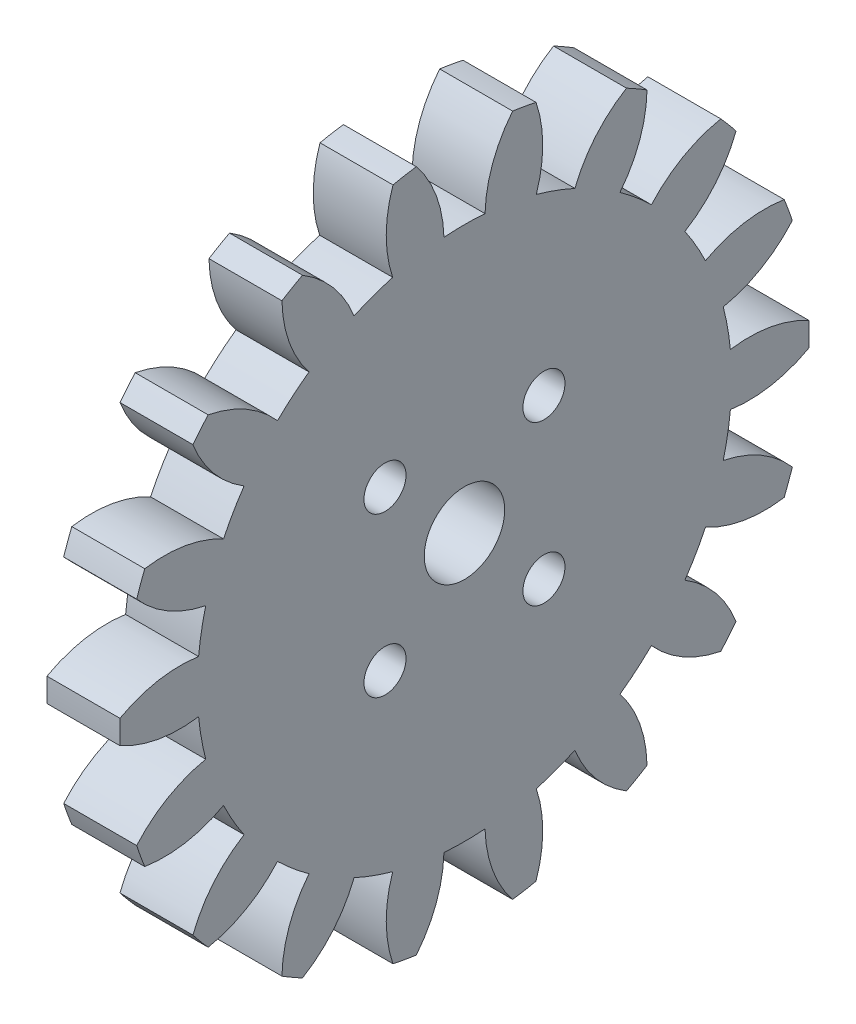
from build123d import *

# Parameters (mm, degrees)
BASPROSKE_W                  = 6.35
BASPROSKE_H                  = 30
TOOTHCUT_DEPTH               = 43.898980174
TEETHCUTS_COUNT              = 18
TEETHCUTS_ANGLE              = 340
BORSKE_R                     = 3.5
BORE_DEPTH                   = 50.0000508
ENL_V_MAT_EXTRU_1_REACH      = 44.694
ESQUISSE1_R                  = 1.83
R_P_TITION_CIRCULAIRE1_COUNT = 4


with BuildPart() as part:
    # BasProSke → Base-Revolve (revolve)
    with BuildSketch(Plane(origin=(0, 0, 0), x_dir=(1, 0, 0), z_dir=(0, 1, 0)), mode=Mode.PRIVATE) as base_revolve_sk:
        with Locations((3.175, 15)):
            Rectangle(BASPROSKE_W, BASPROSKE_H)
    revolve(base_revolve_sk.sketch.rotate(Axis((-10, 0, 0), (1, 0, 0)), 180), axis=Axis((-10, 0, 0), (1, 0, 0)))

    # TooCutSke → ToothCut (cut, through all)
    with BuildSketch(Plane(origin=(0, 0, 0), x_dir=(0, 0, -1), z_dir=(1, 0, 0))):
        with BuildLine():
            ThreePointArc((1.787960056, 23.180146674), (0, 23.249), (-1.787960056, 23.180146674))
            ThreePointArc((-1.787960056, 23.180146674), (-2.454446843, 26.655567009), (-4.20853261, 29.728990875))
            ThreePointArc((-4.20853261, 29.728990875), (0, 30.0254), (4.20853261, 29.728990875))
            ThreePointArc((4.20853261, 29.728990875), (2.454446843, 26.655567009), (1.787960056, 23.180146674))
        make_face()
    toothcut = extrude(amount=TOOTHCUT_DEPTH, mode=Mode.SUBTRACT)

    # TeethCuts: ToothCut ×18 about axis
    teethcuts_axis = Axis((-10, 0, 0), (1, 0, 0))
    for i in range(1, TEETHCUTS_COUNT):
        add(toothcut.rotate(teethcuts_axis, i * TEETHCUTS_ANGLE / (TEETHCUTS_COUNT - 1)), mode=Mode.SUBTRACT)

    # BorSke → Bore (cut, symmetric)
    with BuildSketch(Plane(origin=(0, 0, 0), x_dir=(0, 0, -1), z_dir=(1, 0, 0))):
        with Locations(Location((0, 0, 0), (0, 0, 180))):
            Circle(BORSKE_R)
    extrude(amount=BORE_DEPTH, both=True, mode=Mode.SUBTRACT)

    # Esquisse1 → Enl_v. mat.-Extru.1 (cut, up to next)
    with BuildSketch(Plane.ZY, mode=Mode.PRIVATE) as enl_v_mat_extru_1_sk1:
        with Locations((-6.914797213, 6.914797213)):
            Circle(ESQUISSE1_R)
    enl_v_mat_extru_1_tool1 = extrude(enl_v_mat_extru_1_sk1.sketch, amount=-ENL_V_MAT_EXTRU_1_REACH, mode=Mode.PRIVATE) & part.part
    enl_v_mat_extru_1 = enl_v_mat_extru_1_tool1.solids().sort_by_distance((0, 6.914797, -6.914797))[0]
    add(enl_v_mat_extru_1, mode=Mode.SUBTRACT)

    # R_p_tition circulaire1: Enl_v. mat.-Extru.1 ×4 about axis
    r_p_tition_circulaire1_axis = Axis((0, 0, 0), (1, 0, 0))
    for i in range(1, R_P_TITION_CIRCULAIRE1_COUNT):
        add(enl_v_mat_extru_1.rotate(r_p_tition_circulaire1_axis, i * 360 / R_P_TITION_CIRCULAIRE1_COUNT), mode=Mode.SUBTRACT)


solid = part.part
